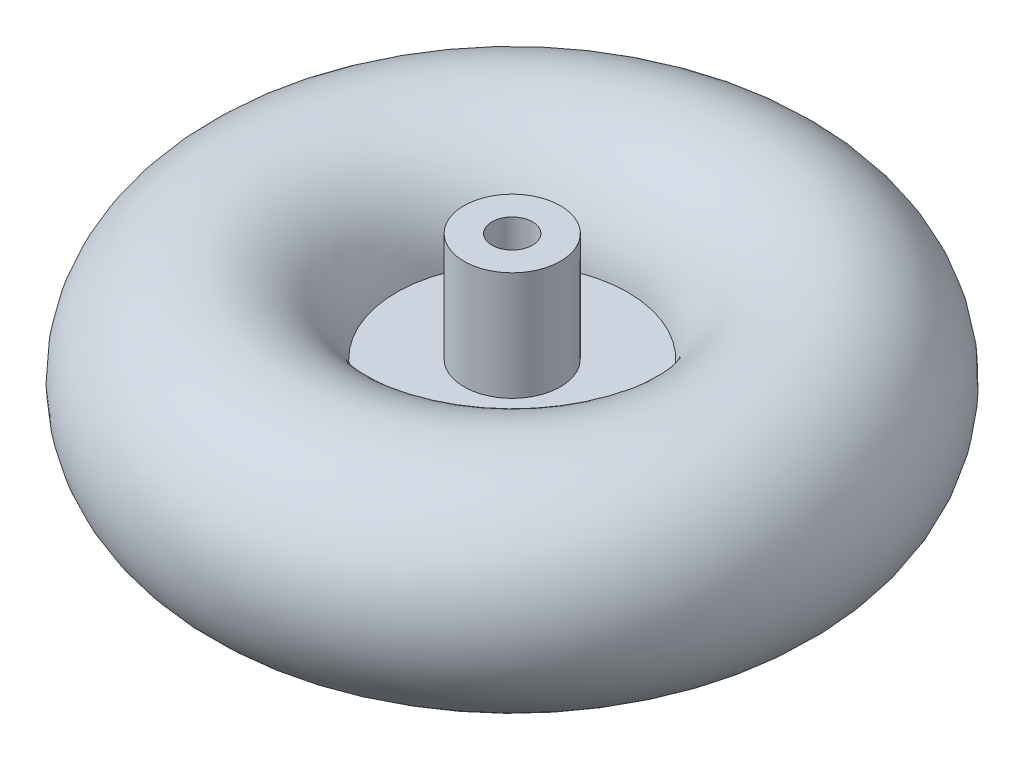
from build123d import *


with BuildPart() as part:
    # Esquisse1 → R_volution1 (revolve)
    with BuildSketch(Plane.XY, mode=Mode.PRIVATE) as r_volution1_sk:
        with BuildLine():
            Line((-8, 50), (-8, 0))
            Line((-8, 0), (-45, 0))
            ThreePointArc((-45, 0), (-129.849285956, -3.576028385), (-45.601787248, 7.126694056))
            Line((-45.601787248, 7.126694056), (-19, 7.126694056))
            Line((-19, 7.126694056), (-19, 50))
            Line((-19, 50), (-8, 50))
        make_face()
    revolve(r_volution1_sk.sketch.rotate(Axis((0, 0, 0), (0, 1, 0)), 270), axis=Axis((0, 0, 0), (0, 1, 0)))


solid = part.part
